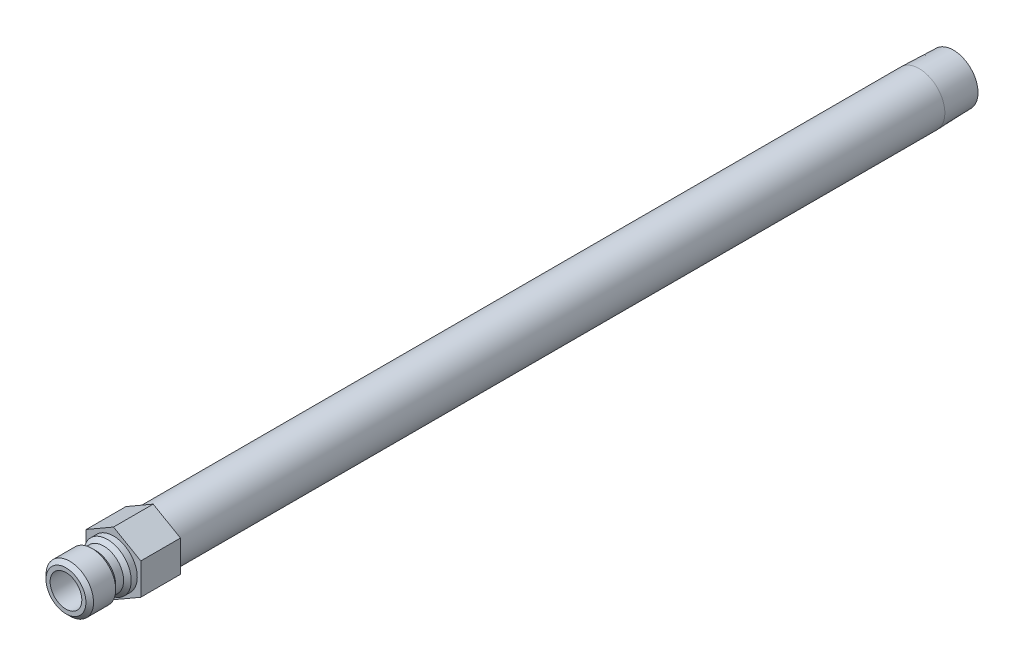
ISO-10303-21;
HEADER;
FILE_DESCRIPTION(('STEP AP214'),'2;1');
FILE_NAME('part.step','',(''),(''),'','','');
FILE_SCHEMA(('AUTOMOTIVE_DESIGN { 1 0 10303 214 1 1 1 1 }'));
ENDSEC;
DATA;
#1=APPLICATION_CONTEXT('core data for automotive mechanical design processes');
#2=APPLICATION_PROTOCOL_DEFINITION('international standard','automotive_design',2000,#1);
#3=PRODUCT_CONTEXT('',#1,'mechanical');
#4=PRODUCT('Part','Part','',(#3));
#5=PRODUCT_RELATED_PRODUCT_CATEGORY('part','',(#4));
#6=PRODUCT_DEFINITION_FORMATION('','',#4);
#7=PRODUCT_DEFINITION_CONTEXT('part definition',#1,'design');
#8=PRODUCT_DEFINITION('design','',#6,#7);
#9=PRODUCT_DEFINITION_SHAPE('','',#8);
#10=(LENGTH_UNIT() NAMED_UNIT(*) SI_UNIT(.MILLI.,.METRE.));
#11=(NAMED_UNIT(*) PLANE_ANGLE_UNIT() SI_UNIT($,.RADIAN.));
#12=(NAMED_UNIT(*) SI_UNIT($,.STERADIAN.) SOLID_ANGLE_UNIT());
#13=UNCERTAINTY_MEASURE_WITH_UNIT(LENGTH_MEASURE(1.E-05),#10,'distance_accuracy_value','');
#14=(GEOMETRIC_REPRESENTATION_CONTEXT(3) GLOBAL_UNCERTAINTY_ASSIGNED_CONTEXT((#13)) GLOBAL_UNIT_ASSIGNED_CONTEXT((#10,
#11,#12)) REPRESENTATION_CONTEXT('',''));
#15=CARTESIAN_POINT('',(0.,0.,0.));
#16=DIRECTION('',(0.,0.,1.));
#17=DIRECTION('',(1.,0.,0.));
#18=AXIS2_PLACEMENT_3D('',#15,#16,#17);
#19=CARTESIAN_POINT('',(0.,4.7625,0.));
#20=DIRECTION('',(0.,0.,1.));
#21=DIRECTION('',(0.,-1.,0.));
#22=AXIS2_PLACEMENT_3D('',#19,#20,#21);
#23=PLANE('',#22);
#24=CARTESIAN_POINT('',(0.,0.,0.));
#25=DIRECTION('',(0.,0.,-1.));
#26=DIRECTION('',(0.,1.,0.));
#27=AXIS2_PLACEMENT_3D('',#24,#25,#26);
#28=CIRCLE('',#27,4.7625);
#29=CARTESIAN_POINT('',(0.,4.7625,0.));
#30=VERTEX_POINT('',#29);
#31=EDGE_CURVE('E166',#30,#30,#28,.T.);
#32=ORIENTED_EDGE('',*,*,#31,.T.);
#33=EDGE_LOOP('',(#32));
#34=FACE_BOUND('',#33,.T.);
#35=DIRECTION('',(-0.866025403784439,-0.5,0.));
#36=VECTOR('',#35,1.);
#37=CARTESIAN_POINT('',(0.,6.3058196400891,0.));
#38=LINE('',#37,#36);
#39=CARTESIAN_POINT('',(0.,6.3058196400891,0.));
#40=VERTEX_POINT('',#39);
#41=CARTESIAN_POINT('',(-5.461,3.15290982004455,0.));
#42=VERTEX_POINT('',#41);
#43=EDGE_CURVE('E122',#40,#42,#38,.T.);
#44=ORIENTED_EDGE('',*,*,#43,.T.);
#45=DIRECTION('',(0.,-1.,0.));
#46=VECTOR('',#45,1.);
#47=CARTESIAN_POINT('',(-5.461,3.15290982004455,0.));
#48=LINE('',#47,#46);
#49=CARTESIAN_POINT('',(-5.461,-3.15290982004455,0.));
#50=VERTEX_POINT('',#49);
#51=EDGE_CURVE('E125',#42,#50,#48,.T.);
#52=ORIENTED_EDGE('',*,*,#51,.T.);
#53=DIRECTION('',(0.866025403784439,-0.5,0.));
#54=VECTOR('',#53,1.);
#55=CARTESIAN_POINT('',(-5.461,-3.15290982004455,0.));
#56=LINE('',#55,#54);
#57=CARTESIAN_POINT('',(0.,-6.30581964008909,0.));
#58=VERTEX_POINT('',#57);
#59=EDGE_CURVE('E129',#50,#58,#56,.T.);
#60=ORIENTED_EDGE('',*,*,#59,.T.);
#61=DIRECTION('',(0.866025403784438,0.5,0.));
#62=VECTOR('',#61,1.);
#63=CARTESIAN_POINT('',(0.,-6.30581964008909,0.));
#64=LINE('',#63,#62);
#65=CARTESIAN_POINT('',(5.461,-3.15290982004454,0.));
#66=VERTEX_POINT('',#65);
#67=EDGE_CURVE('E132',#58,#66,#64,.T.);
#68=ORIENTED_EDGE('',*,*,#67,.T.);
#69=DIRECTION('',(0.,1.,0.));
#70=VECTOR('',#69,1.);
#71=CARTESIAN_POINT('',(5.461,-3.15290982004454,0.));
#72=LINE('',#71,#70);
#73=CARTESIAN_POINT('',(5.461,3.15290982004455,0.));
#74=VERTEX_POINT('',#73);
#75=EDGE_CURVE('E99',#66,#74,#72,.T.);
#76=ORIENTED_EDGE('',*,*,#75,.T.);
#77=DIRECTION('',(-0.866025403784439,0.5,0.));
#78=VECTOR('',#77,1.);
#79=CARTESIAN_POINT('',(5.461,3.15290982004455,0.));
#80=LINE('',#79,#78);
#81=EDGE_CURVE('E135',#74,#40,#80,.T.);
#82=ORIENTED_EDGE('',*,*,#81,.T.);
#83=EDGE_LOOP('',(#44,#52,#60,#68,#76,#82));
#84=FACE_BOUND('',#83,.T.);
#85=ADVANCED_FACE('F33',(#34,#84),#23,.T.);
#86=CARTESIAN_POINT('',(0.,0.,0.));
#87=DIRECTION('',(0.,0.,-1.));
#88=DIRECTION('',(0.,1.,0.));
#89=AXIS2_PLACEMENT_3D('',#86,#87,#88);
#90=CYLINDRICAL_SURFACE('',#89,4.7625);
#91=CARTESIAN_POINT('',(0.,0.,1.2065));
#92=DIRECTION('',(0.,0.,-1.));
#93=DIRECTION('',(0.,1.,0.));
#94=AXIS2_PLACEMENT_3D('',#91,#92,#93);
#95=CIRCLE('',#94,4.7625);
#96=CARTESIAN_POINT('',(0.,4.7625,1.2065));
#97=VERTEX_POINT('',#96);
#98=EDGE_CURVE('E163',#97,#97,#95,.T.);
#99=ORIENTED_EDGE('',*,*,#98,.T.);
#100=EDGE_LOOP('',(#99));
#101=FACE_BOUND('',#100,.T.);
#102=ORIENTED_EDGE('',*,*,#31,.F.);
#103=EDGE_LOOP('',(#102));
#104=FACE_BOUND('',#103,.T.);
#105=ADVANCED_FACE('F192',(#101,#104),#90,.T.);
#106=CARTESIAN_POINT('',(0.,0.,1.2065));
#107=DIRECTION('',(0.,0.,-1.));
#108=DIRECTION('',(0.,1.,0.));
#109=AXIS2_PLACEMENT_3D('',#106,#107,#108);
#110=CONICAL_SURFACE('',#109,4.7625,0.785398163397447);
#111=CARTESIAN_POINT('',(0.,0.,1.9685));
#112=DIRECTION('',(0.,0.,-1.));
#113=DIRECTION('',(0.,1.,0.));
#114=AXIS2_PLACEMENT_3D('',#111,#112,#113);
#115=CIRCLE('',#114,4.0005);
#116=CARTESIAN_POINT('',(0.,4.0005,1.9685));
#117=VERTEX_POINT('',#116);
#118=EDGE_CURVE('E160',#117,#117,#115,.T.);
#119=ORIENTED_EDGE('',*,*,#118,.T.);
#120=EDGE_LOOP('',(#119));
#121=FACE_BOUND('',#120,.T.);
#122=ORIENTED_EDGE('',*,*,#98,.F.);
#123=EDGE_LOOP('',(#122));
#124=FACE_BOUND('',#123,.T.);
#125=ADVANCED_FACE('F198',(#121,#124),#110,.T.);
#126=CARTESIAN_POINT('',(0.,0.,0.));
#127=DIRECTION('',(0.,0.,-1.));
#128=DIRECTION('',(0.,1.,0.));
#129=AXIS2_PLACEMENT_3D('',#126,#127,#128);
#130=CYLINDRICAL_SURFACE('',#129,4.0005);
#131=CARTESIAN_POINT('',(0.,0.,3.556));
#132=DIRECTION('',(0.,0.,-1.));
#133=DIRECTION('',(0.,1.,0.));
#134=AXIS2_PLACEMENT_3D('',#131,#132,#133);
#135=CIRCLE('',#134,4.0005);
#136=CARTESIAN_POINT('',(0.,4.0005,3.556));
#137=VERTEX_POINT('',#136);
#138=EDGE_CURVE('E157',#137,#137,#135,.T.);
#139=ORIENTED_EDGE('',*,*,#138,.T.);
#140=EDGE_LOOP('',(#139));
#141=FACE_BOUND('',#140,.T.);
#142=ORIENTED_EDGE('',*,*,#118,.F.);
#143=EDGE_LOOP('',(#142));
#144=FACE_BOUND('',#143,.T.);
#145=ADVANCED_FACE('F258',(#141,#144),#130,.T.);
#146=CARTESIAN_POINT('',(0.,0.,3.556));
#147=DIRECTION('',(0.,0.,1.));
#148=DIRECTION('',(0.,-1.,0.));
#149=AXIS2_PLACEMENT_3D('',#146,#147,#148);
#150=CONICAL_SURFACE('',#149,4.0005,0.785398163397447);
#151=CARTESIAN_POINT('',(0.,0.,4.318));
#152=DIRECTION('',(0.,0.,-1.));
#153=DIRECTION('',(0.,1.,0.));
#154=AXIS2_PLACEMENT_3D('',#151,#152,#153);
#155=CIRCLE('',#154,4.7625);
#156=CARTESIAN_POINT('',(0.,4.7625,4.318));
#157=VERTEX_POINT('',#156);
#158=EDGE_CURVE('E154',#157,#157,#155,.T.);
#159=ORIENTED_EDGE('',*,*,#158,.T.);
#160=EDGE_LOOP('',(#159));
#161=FACE_BOUND('',#160,.T.);
#162=ORIENTED_EDGE('',*,*,#138,.F.);
#163=EDGE_LOOP('',(#162));
#164=FACE_BOUND('',#163,.T.);
#165=ADVANCED_FACE('F254',(#161,#164),#150,.T.);
#166=CARTESIAN_POINT('',(0.,0.,0.));
#167=DIRECTION('',(0.,0.,-1.));
#168=DIRECTION('',(0.,1.,0.));
#169=AXIS2_PLACEMENT_3D('',#166,#167,#168);
#170=CYLINDRICAL_SURFACE('',#169,4.7625);
#171=CARTESIAN_POINT('',(0.,0.,8.763));
#172=DIRECTION('',(0.,0.,-1.));
#173=DIRECTION('',(0.,1.,0.));
#174=AXIS2_PLACEMENT_3D('',#171,#172,#173);
#175=CIRCLE('',#174,4.7625);
#176=CARTESIAN_POINT('',(0.,4.7625,8.763));
#177=VERTEX_POINT('',#176);
#178=EDGE_CURVE('E151',#177,#177,#175,.T.);
#179=ORIENTED_EDGE('',*,*,#178,.T.);
#180=EDGE_LOOP('',(#179));
#181=FACE_BOUND('',#180,.T.);
#182=ORIENTED_EDGE('',*,*,#158,.F.);
#183=EDGE_LOOP('',(#182));
#184=FACE_BOUND('',#183,.T.);
#185=ADVANCED_FACE('F250',(#181,#184),#170,.T.);
#186=CARTESIAN_POINT('',(0.,0.,8.763));
#187=DIRECTION('',(0.,0.,-1.));
#188=DIRECTION('',(0.,1.,0.));
#189=AXIS2_PLACEMENT_3D('',#186,#187,#188);
#190=CONICAL_SURFACE('',#189,4.7625,0.785398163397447);
#191=CARTESIAN_POINT('',(0.,0.,9.525));
#192=DIRECTION('',(0.,0.,-1.));
#193=DIRECTION('',(0.,1.,0.));
#194=AXIS2_PLACEMENT_3D('',#191,#192,#193);
#195=CIRCLE('',#194,4.0005);
#196=CARTESIAN_POINT('',(0.,4.0005,9.525));
#197=VERTEX_POINT('',#196);
#198=EDGE_CURVE('E148',#197,#197,#195,.T.);
#199=ORIENTED_EDGE('',*,*,#198,.T.);
#200=EDGE_LOOP('',(#199));
#201=FACE_BOUND('',#200,.T.);
#202=ORIENTED_EDGE('',*,*,#178,.F.);
#203=EDGE_LOOP('',(#202));
#204=FACE_BOUND('',#203,.T.);
#205=ADVANCED_FACE('F246',(#201,#204),#190,.T.);
#206=CARTESIAN_POINT('',(0.,3.175,9.525));
#207=DIRECTION('',(0.,0.,1.));
#208=DIRECTION('',(0.,-1.,0.));
#209=AXIS2_PLACEMENT_3D('',#206,#207,#208);
#210=PLANE('',#209);
#211=CARTESIAN_POINT('',(0.,0.,9.525));
#212=DIRECTION('',(0.,0.,-1.));
#213=DIRECTION('',(0.,1.,0.));
#214=AXIS2_PLACEMENT_3D('',#211,#212,#213);
#215=CIRCLE('',#214,3.175);
#216=CARTESIAN_POINT('',(0.,3.175,9.525));
#217=VERTEX_POINT('',#216);
#218=EDGE_CURVE('E145',#217,#217,#215,.T.);
#219=ORIENTED_EDGE('',*,*,#218,.T.);
#220=EDGE_LOOP('',(#219));
#221=FACE_BOUND('',#220,.T.);
#222=ORIENTED_EDGE('',*,*,#198,.F.);
#223=EDGE_LOOP('',(#222));
#224=FACE_BOUND('',#223,.T.);
#225=ADVANCED_FACE('F242',(#221,#224),#210,.T.);
#226=CARTESIAN_POINT('',(0.,0.,0.));
#227=DIRECTION('',(0.,0.,-1.));
#228=DIRECTION('',(0.,1.,0.));
#229=AXIS2_PLACEMENT_3D('',#226,#227,#228);
#230=CYLINDRICAL_SURFACE('',#229,3.175);
#231=CARTESIAN_POINT('',(0.,0.,0.));
#232=DIRECTION('',(0.,0.,1.));
#233=DIRECTION('',(1.,0.,0.));
#234=AXIS2_PLACEMENT_3D('',#231,#232,#233);
#235=CIRCLE('',#234,3.175);
#236=CARTESIAN_POINT('',(3.175,0.,0.));
#237=VERTEX_POINT('',#236);
#238=EDGE_CURVE('E11',#237,#237,#235,.T.);
#239=ORIENTED_EDGE('',*,*,#238,.F.);
#240=EDGE_LOOP('',(#239));
#241=FACE_BOUND('',#240,.T.);
#242=ORIENTED_EDGE('',*,*,#218,.F.);
#243=EDGE_LOOP('',(#242));
#244=FACE_BOUND('',#243,.T.);
#245=ADVANCED_FACE('F226',(#241,#244),#230,.F.);
#246=CARTESIAN_POINT('',(-5.461,3.15290982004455,0.));
#247=DIRECTION('',(0.,0.,1.));
#248=DIRECTION('',(1.,0.,0.));
#249=AXIS2_PLACEMENT_3D('',#246,#247,#248);
#250=PLANE('',#249);
#251=ORIENTED_EDGE('',*,*,#238,.T.);
#252=EDGE_LOOP('',(#251));
#253=FACE_BOUND('',#252,.T.);
#254=CARTESIAN_POINT('',(0.,0.,0.));
#255=DIRECTION('',(0.,0.,1.));
#256=DIRECTION('',(1.,0.,0.));
#257=AXIS2_PLACEMENT_3D('',#254,#255,#256);
#258=CIRCLE('',#257,2.38124999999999);
#259=CARTESIAN_POINT('',(2.38124999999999,0.,0.));
#260=VERTEX_POINT('',#259);
#261=EDGE_CURVE('E126',#260,#260,#258,.T.);
#262=ORIENTED_EDGE('',*,*,#261,.F.);
#263=EDGE_LOOP('',(#262));
#264=FACE_BOUND('',#263,.T.);
#265=ADVANCED_FACE('F222',(#253,#264),#250,.T.);
#266=CARTESIAN_POINT('',(0.,6.3058196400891,-7.9502));
#267=DIRECTION('',(-0.5,0.866025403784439,0.));
#268=DIRECTION('',(-0.866025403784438,-0.5,0.));
#269=AXIS2_PLACEMENT_3D('',#266,#267,#268);
#270=PLANE('',#269);
#271=ORIENTED_EDGE('',*,*,#43,.F.);
#272=DIRECTION('',(0.,0.,1.));
#273=VECTOR('',#272,1.);
#274=CARTESIAN_POINT('',(0.,6.3058196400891,-7.9502));
#275=LINE('',#274,#273);
#276=CARTESIAN_POINT('',(0.,6.3058196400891,-7.9502));
#277=VERTEX_POINT('',#276);
#278=EDGE_CURVE('E51',#277,#40,#275,.T.);
#279=ORIENTED_EDGE('',*,*,#278,.F.);
#280=DIRECTION('',(-0.866025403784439,-0.5,0.));
#281=VECTOR('',#280,1.);
#282=CARTESIAN_POINT('',(0.,6.3058196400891,-7.9502));
#283=LINE('',#282,#281);
#284=CARTESIAN_POINT('',(-5.461,3.15290982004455,-7.9502));
#285=VERTEX_POINT('',#284);
#286=EDGE_CURVE('E138',#277,#285,#283,.T.);
#287=ORIENTED_EDGE('',*,*,#286,.T.);
#288=DIRECTION('',(0.,0.,1.));
#289=VECTOR('',#288,1.);
#290=CARTESIAN_POINT('',(-5.461,3.15290982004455,-7.9502));
#291=LINE('',#290,#289);
#292=EDGE_CURVE('E86',#285,#42,#291,.T.);
#293=ORIENTED_EDGE('',*,*,#292,.T.);
#294=EDGE_LOOP('',(#271,#279,#287,#293));
#295=FACE_BOUND('',#294,.T.);
#296=ADVANCED_FACE('F225',(#295),#270,.T.);
#297=CARTESIAN_POINT('',(5.461,3.15290982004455,-7.9502));
#298=DIRECTION('',(0.5,0.866025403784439,0.));
#299=DIRECTION('',(-0.866025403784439,0.5,0.));
#300=AXIS2_PLACEMENT_3D('',#297,#298,#299);
#301=PLANE('',#300);
#302=ORIENTED_EDGE('',*,*,#81,.F.);
#303=DIRECTION('',(0.,0.,1.));
#304=VECTOR('',#303,1.);
#305=CARTESIAN_POINT('',(5.461,3.15290982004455,-7.9502));
#306=LINE('',#305,#304);
#307=CARTESIAN_POINT('',(5.461,3.15290982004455,-7.9502));
#308=VERTEX_POINT('',#307);
#309=EDGE_CURVE('E74',#308,#74,#306,.T.);
#310=ORIENTED_EDGE('',*,*,#309,.F.);
#311=DIRECTION('',(-0.866025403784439,0.5,0.));
#312=VECTOR('',#311,1.);
#313=CARTESIAN_POINT('',(5.461,3.15290982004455,-7.9502));
#314=LINE('',#313,#312);
#315=EDGE_CURVE('E112',#308,#277,#314,.T.);
#316=ORIENTED_EDGE('',*,*,#315,.T.);
#317=ORIENTED_EDGE('',*,*,#278,.T.);
#318=EDGE_LOOP('',(#302,#310,#316,#317));
#319=FACE_BOUND('',#318,.T.);
#320=ADVANCED_FACE('F228',(#319),#301,.T.);
#321=CARTESIAN_POINT('',(5.461,-3.15290982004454,-7.9502));
#322=DIRECTION('',(1.,0.,0.));
#323=DIRECTION('',(0.,1.,0.));
#324=AXIS2_PLACEMENT_3D('',#321,#322,#323);
#325=PLANE('',#324);
#326=ORIENTED_EDGE('',*,*,#75,.F.);
#327=DIRECTION('',(0.,0.,1.));
#328=VECTOR('',#327,1.);
#329=CARTESIAN_POINT('',(5.461,-3.15290982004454,-7.9502));
#330=LINE('',#329,#328);
#331=CARTESIAN_POINT('',(5.461,-3.15290982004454,-7.9502));
#332=VERTEX_POINT('',#331);
#333=EDGE_CURVE('E94',#332,#66,#330,.T.);
#334=ORIENTED_EDGE('',*,*,#333,.F.);
#335=DIRECTION('',(0.,1.,0.));
#336=VECTOR('',#335,1.);
#337=CARTESIAN_POINT('',(5.461,-3.15290982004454,-7.9502));
#338=LINE('',#337,#336);
#339=EDGE_CURVE('E97',#332,#308,#338,.T.);
#340=ORIENTED_EDGE('',*,*,#339,.T.);
#341=ORIENTED_EDGE('',*,*,#309,.T.);
#342=EDGE_LOOP('',(#326,#334,#340,#341));
#343=FACE_BOUND('',#342,.T.);
#344=ADVANCED_FACE('F96',(#343),#325,.T.);
#345=CARTESIAN_POINT('',(0.,-6.30581964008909,-7.9502));
#346=DIRECTION('',(0.5,-0.866025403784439,0.));
#347=DIRECTION('',(0.866025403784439,0.5,0.));
#348=AXIS2_PLACEMENT_3D('',#345,#346,#347);
#349=PLANE('',#348);
#350=ORIENTED_EDGE('',*,*,#67,.F.);
#351=DIRECTION('',(0.,0.,1.));
#352=VECTOR('',#351,1.);
#353=CARTESIAN_POINT('',(0.,-6.30581964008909,-7.9502));
#354=LINE('',#353,#352);
#355=CARTESIAN_POINT('',(0.,-6.30581964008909,-7.9502));
#356=VERTEX_POINT('',#355);
#357=EDGE_CURVE('E104',#356,#58,#354,.T.);
#358=ORIENTED_EDGE('',*,*,#357,.F.);
#359=DIRECTION('',(0.866025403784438,0.5,0.));
#360=VECTOR('',#359,1.);
#361=CARTESIAN_POINT('',(0.,-6.30581964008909,-7.9502));
#362=LINE('',#361,#360);
#363=EDGE_CURVE('E110',#356,#332,#362,.T.);
#364=ORIENTED_EDGE('',*,*,#363,.T.);
#365=ORIENTED_EDGE('',*,*,#333,.T.);
#366=EDGE_LOOP('',(#350,#358,#364,#365));
#367=FACE_BOUND('',#366,.T.);
#368=ADVANCED_FACE('F114',(#367),#349,.T.);
#369=CARTESIAN_POINT('',(-5.461,-3.15290982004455,-7.9502));
#370=DIRECTION('',(-0.5,-0.866025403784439,0.));
#371=DIRECTION('',(0.866025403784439,-0.5,0.));
#372=AXIS2_PLACEMENT_3D('',#369,#370,#371);
#373=PLANE('',#372);
#374=ORIENTED_EDGE('',*,*,#59,.F.);
#375=DIRECTION('',(0.,0.,1.));
#376=VECTOR('',#375,1.);
#377=CARTESIAN_POINT('',(-5.461,-3.15290982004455,-7.9502));
#378=LINE('',#377,#376);
#379=CARTESIAN_POINT('',(-5.461,-3.15290982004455,-7.9502));
#380=VERTEX_POINT('',#379);
#381=EDGE_CURVE('E142',#380,#50,#378,.T.);
#382=ORIENTED_EDGE('',*,*,#381,.F.);
#383=DIRECTION('',(0.866025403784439,-0.5,0.));
#384=VECTOR('',#383,1.);
#385=CARTESIAN_POINT('',(-5.461,-3.15290982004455,-7.9502));
#386=LINE('',#385,#384);
#387=EDGE_CURVE('E115',#380,#356,#386,.T.);
#388=ORIENTED_EDGE('',*,*,#387,.T.);
#389=ORIENTED_EDGE('',*,*,#357,.T.);
#390=EDGE_LOOP('',(#374,#382,#388,#389));
#391=FACE_BOUND('',#390,.T.);
#392=ADVANCED_FACE('F219',(#391),#373,.T.);
#393=CARTESIAN_POINT('',(-5.461,3.15290982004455,-7.9502));
#394=DIRECTION('',(-1.,0.,0.));
#395=DIRECTION('',(0.,0.,1.));
#396=AXIS2_PLACEMENT_3D('',#393,#394,#395);
#397=PLANE('',#396);
#398=ORIENTED_EDGE('',*,*,#51,.F.);
#399=ORIENTED_EDGE('',*,*,#292,.F.);
#400=DIRECTION('',(0.,-1.,0.));
#401=VECTOR('',#400,1.);
#402=CARTESIAN_POINT('',(-5.461,3.15290982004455,-7.9502));
#403=LINE('',#402,#401);
#404=EDGE_CURVE('E117',#285,#380,#403,.T.);
#405=ORIENTED_EDGE('',*,*,#404,.T.);
#406=ORIENTED_EDGE('',*,*,#381,.T.);
#407=EDGE_LOOP('',(#398,#399,#405,#406));
#408=FACE_BOUND('',#407,.T.);
#409=ADVANCED_FACE('F214',(#408),#397,.T.);
#410=CARTESIAN_POINT('',(-5.461,3.15290982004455,-7.9502));
#411=DIRECTION('',(0.,0.,1.));
#412=DIRECTION('',(1.,0.,0.));
#413=AXIS2_PLACEMENT_3D('',#410,#411,#412);
#414=PLANE('',#413);
#415=CARTESIAN_POINT('',(0.,0.,-7.9502));
#416=DIRECTION('',(0.,0.,1.));
#417=DIRECTION('',(1.,0.,0.));
#418=AXIS2_PLACEMENT_3D('',#415,#416,#417);
#419=CIRCLE('',#418,5.14349999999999);
#420=CARTESIAN_POINT('',(5.14349999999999,0.,-7.9502));
#421=VERTEX_POINT('',#420);
#422=EDGE_CURVE('E37',#421,#421,#419,.F.);
#423=ORIENTED_EDGE('',*,*,#422,.F.);
#424=EDGE_LOOP('',(#423));
#425=FACE_BOUND('',#424,.T.);
#426=ORIENTED_EDGE('',*,*,#286,.F.);
#427=ORIENTED_EDGE('',*,*,#315,.F.);
#428=ORIENTED_EDGE('',*,*,#339,.F.);
#429=ORIENTED_EDGE('',*,*,#363,.F.);
#430=ORIENTED_EDGE('',*,*,#387,.F.);
#431=ORIENTED_EDGE('',*,*,#404,.F.);
#432=EDGE_LOOP('',(#426,#427,#428,#429,#430,#431));
#433=FACE_BOUND('',#432,.T.);
#434=ADVANCED_FACE('F108',(#425,#433),#414,.F.);
#435=CARTESIAN_POINT('',(0.,0.,0.));
#436=DIRECTION('',(0.,0.,-1.));
#437=DIRECTION('',(0.,1.,0.));
#438=AXIS2_PLACEMENT_3D('',#435,#436,#437);
#439=CYLINDRICAL_SURFACE('',#438,2.38124999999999);
#440=CARTESIAN_POINT('',(0.,0.,-168.275));
#441=DIRECTION('',(0.,0.,-1.));
#442=DIRECTION('',(0.,1.,0.));
#443=AXIS2_PLACEMENT_3D('',#440,#441,#442);
#444=CIRCLE('',#443,2.38124999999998);
#445=CARTESIAN_POINT('',(0.,2.38125,-168.275));
#446=VERTEX_POINT('',#445);
#447=EDGE_CURVE('E43',#446,#446,#444,.T.);
#448=ORIENTED_EDGE('',*,*,#447,.T.);
#449=EDGE_LOOP('',(#448));
#450=FACE_BOUND('',#449,.T.);
#451=ORIENTED_EDGE('',*,*,#261,.T.);
#452=EDGE_LOOP('',(#451));
#453=FACE_BOUND('',#452,.T.);
#454=ADVANCED_FACE('F35',(#450,#453),#439,.F.);
#455=CARTESIAN_POINT('',(0.,4.9291887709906,-168.275));
#456=DIRECTION('',(0.,0.,-1.));
#457=DIRECTION('',(0.,1.,0.));
#458=AXIS2_PLACEMENT_3D('',#455,#456,#457);
#459=PLANE('',#458);
#460=CARTESIAN_POINT('',(0.,0.,-168.275));
#461=DIRECTION('',(0.,0.,-1.));
#462=DIRECTION('',(0.,1.,0.));
#463=AXIS2_PLACEMENT_3D('',#460,#461,#462);
#464=CIRCLE('',#463,4.92918877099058);
#465=CARTESIAN_POINT('',(0.,4.9291887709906,-168.275));
#466=VERTEX_POINT('',#465);
#467=EDGE_CURVE('E172',#466,#466,#464,.T.);
#468=ORIENTED_EDGE('',*,*,#467,.T.);
#469=EDGE_LOOP('',(#468));
#470=FACE_BOUND('',#469,.T.);
#471=ORIENTED_EDGE('',*,*,#447,.F.);
#472=EDGE_LOOP('',(#471));
#473=FACE_BOUND('',#472,.T.);
#474=ADVANCED_FACE('F180',(#470,#473),#459,.T.);
#475=CARTESIAN_POINT('',(0.,0.,-168.275));
#476=DIRECTION('',(0.,0.,1.));
#477=DIRECTION('',(0.,-1.,0.));
#478=AXIS2_PLACEMENT_3D('',#475,#476,#477);
#479=CONICAL_SURFACE('',#478,4.92918877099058,0.0312396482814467);
#480=CARTESIAN_POINT('',(0.,0.,-161.417));
#481=DIRECTION('',(0.,0.,-1.));
#482=DIRECTION('',(0.,1.,0.));
#483=AXIS2_PLACEMENT_3D('',#480,#481,#482);
#484=CIRCLE('',#483,5.14349999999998);
#485=CARTESIAN_POINT('',(0.,5.1435,-161.417));
#486=VERTEX_POINT('',#485);
#487=EDGE_CURVE('E169',#486,#486,#484,.T.);
#488=ORIENTED_EDGE('',*,*,#487,.T.);
#489=EDGE_LOOP('',(#488));
#490=FACE_BOUND('',#489,.T.);
#491=ORIENTED_EDGE('',*,*,#467,.F.);
#492=EDGE_LOOP('',(#491));
#493=FACE_BOUND('',#492,.T.);
#494=ADVANCED_FACE('F182',(#490,#493),#479,.T.);
#495=CARTESIAN_POINT('',(0.,0.,0.));
#496=DIRECTION('',(0.,0.,-1.));
#497=DIRECTION('',(0.,1.,0.));
#498=AXIS2_PLACEMENT_3D('',#495,#496,#497);
#499=CYLINDRICAL_SURFACE('',#498,5.14349999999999);
#500=ORIENTED_EDGE('',*,*,#487,.F.);
#501=EDGE_LOOP('',(#500));
#502=FACE_BOUND('',#501,.T.);
#503=ORIENTED_EDGE('',*,*,#422,.T.);
#504=EDGE_LOOP('',(#503));
#505=FACE_BOUND('',#504,.T.);
#506=ADVANCED_FACE('F188',(#502,#505),#499,.T.);
#507=CLOSED_SHELL('',(#85,#105,#125,#145,#165,#185,#205,#225,#245,#265,#296,#320,#344,#368,#392,
#409,#434,#454,#474,#494,#506));
#508=MANIFOLD_SOLID_BREP('B2',#507);
#509=ADVANCED_BREP_SHAPE_REPRESENTATION('',(#18,#508),#14);
#510=SHAPE_DEFINITION_REPRESENTATION(#9,#509);
ENDSEC;
END-ISO-10303-21;
